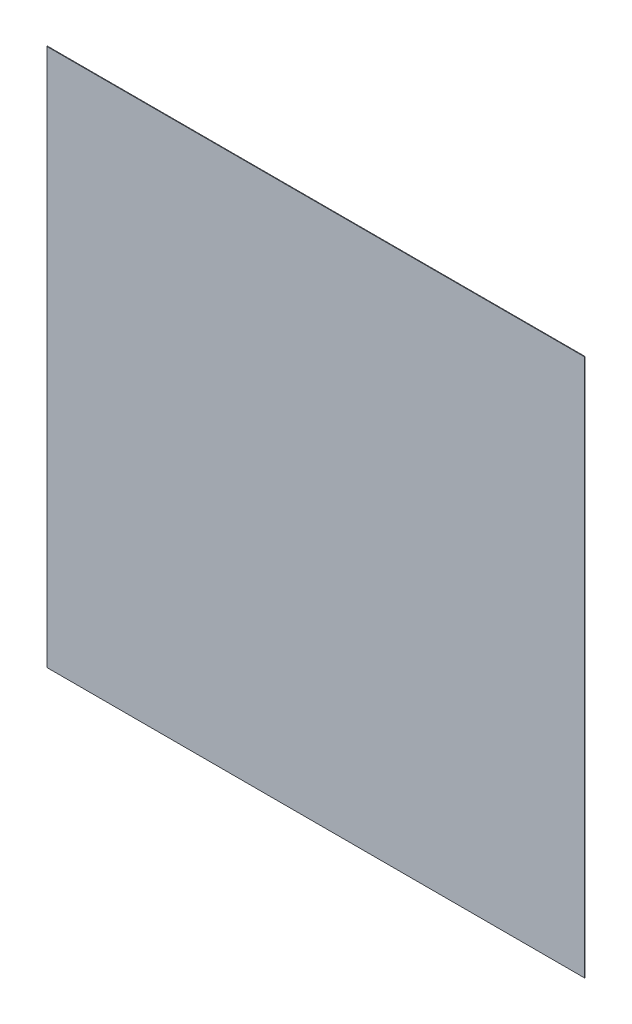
ISO-10303-21;
HEADER;
FILE_DESCRIPTION(('STEP AP214'),'2;1');
FILE_NAME('part.step','',(''),(''),'','','');
FILE_SCHEMA(('AUTOMOTIVE_DESIGN { 1 0 10303 214 1 1 1 1 }'));
ENDSEC;
DATA;
#1=APPLICATION_CONTEXT('core data for automotive mechanical design processes');
#2=APPLICATION_PROTOCOL_DEFINITION('international standard','automotive_design',2000,#1);
#3=PRODUCT_CONTEXT('',#1,'mechanical');
#4=PRODUCT('Part','Part','',(#3));
#5=PRODUCT_RELATED_PRODUCT_CATEGORY('part','',(#4));
#6=PRODUCT_DEFINITION_FORMATION('','',#4);
#7=PRODUCT_DEFINITION_CONTEXT('part definition',#1,'design');
#8=PRODUCT_DEFINITION('design','',#6,#7);
#9=PRODUCT_DEFINITION_SHAPE('','',#8);
#10=(LENGTH_UNIT() NAMED_UNIT(*) SI_UNIT(.MILLI.,.METRE.));
#11=(NAMED_UNIT(*) PLANE_ANGLE_UNIT() SI_UNIT($,.RADIAN.));
#12=(NAMED_UNIT(*) SI_UNIT($,.STERADIAN.) SOLID_ANGLE_UNIT());
#13=UNCERTAINTY_MEASURE_WITH_UNIT(LENGTH_MEASURE(1.E-05),#10,'distance_accuracy_value','');
#14=(GEOMETRIC_REPRESENTATION_CONTEXT(3) GLOBAL_UNCERTAINTY_ASSIGNED_CONTEXT((#13)) GLOBAL_UNIT_ASSIGNED_CONTEXT((#10,
#11,#12)) REPRESENTATION_CONTEXT('',''));
#15=CARTESIAN_POINT('',(0.,0.,0.));
#16=DIRECTION('',(0.,0.,1.));
#17=DIRECTION('',(1.,0.,0.));
#18=AXIS2_PLACEMENT_3D('',#15,#16,#17);
#19=CARTESIAN_POINT('',(0.,0.,0.01));
#20=DIRECTION('',(0.,0.,1.));
#21=DIRECTION('',(1.,0.,0.));
#22=AXIS2_PLACEMENT_3D('',#19,#20,#21);
#23=PLANE('',#22);
#24=DIRECTION('',(1.,0.,0.));
#25=VECTOR('',#24,1.);
#26=CARTESIAN_POINT('',(9.,9.,0.01));
#27=LINE('',#26,#25);
#28=CARTESIAN_POINT('',(0.,9.,0.01));
#29=VERTEX_POINT('',#28);
#30=CARTESIAN_POINT('',(9.,9.,0.01));
#31=VERTEX_POINT('',#30);
#32=EDGE_CURVE('E67',#29,#31,#27,.T.);
#33=ORIENTED_EDGE('',*,*,#32,.F.);
#34=DIRECTION('',(0.,1.,0.));
#35=VECTOR('',#34,1.);
#36=CARTESIAN_POINT('',(0.,9.,0.01));
#37=LINE('',#36,#35);
#38=CARTESIAN_POINT('',(0.,0.,0.01));
#39=VERTEX_POINT('',#38);
#40=EDGE_CURVE('E19',#39,#29,#37,.T.);
#41=ORIENTED_EDGE('',*,*,#40,.F.);
#42=DIRECTION('',(1.,0.,0.));
#43=VECTOR('',#42,1.);
#44=CARTESIAN_POINT('',(0.,0.,0.01));
#45=LINE('',#44,#43);
#46=CARTESIAN_POINT('',(9.,0.,0.01));
#47=VERTEX_POINT('',#46);
#48=EDGE_CURVE('E57',#47,#39,#45,.F.);
#49=ORIENTED_EDGE('',*,*,#48,.F.);
#50=DIRECTION('',(0.,1.,0.));
#51=VECTOR('',#50,1.);
#52=CARTESIAN_POINT('',(9.,0.,0.01));
#53=LINE('',#52,#51);
#54=EDGE_CURVE('E52',#31,#47,#53,.F.);
#55=ORIENTED_EDGE('',*,*,#54,.F.);
#56=EDGE_LOOP('',(#33,#41,#49,#55));
#57=FACE_BOUND('',#56,.T.);
#58=ADVANCED_FACE('F16',(#57),#23,.T.);
#59=CARTESIAN_POINT('',(0.,9.,0.));
#60=DIRECTION('',(-1.,0.,0.));
#61=DIRECTION('',(0.,0.,1.));
#62=AXIS2_PLACEMENT_3D('',#59,#60,#61);
#63=PLANE('',#62);
#64=DIRECTION('',(0.,0.,1.));
#65=VECTOR('',#64,1.);
#66=CARTESIAN_POINT('',(0.,9.,0.));
#67=LINE('',#66,#65);
#68=CARTESIAN_POINT('',(0.,9.,0.));
#69=VERTEX_POINT('',#68);
#70=EDGE_CURVE('E78',#69,#29,#67,.T.);
#71=ORIENTED_EDGE('',*,*,#70,.F.);
#72=DIRECTION('',(0.,1.,0.));
#73=VECTOR('',#72,1.);
#74=CARTESIAN_POINT('',(0.,0.,0.));
#75=LINE('',#74,#73);
#76=CARTESIAN_POINT('',(0.,0.,0.));
#77=VERTEX_POINT('',#76);
#78=EDGE_CURVE('E73',#69,#77,#75,.F.);
#79=ORIENTED_EDGE('',*,*,#78,.T.);
#80=DIRECTION('',(0.,0.,-1.));
#81=VECTOR('',#80,1.);
#82=CARTESIAN_POINT('',(0.,0.,0.));
#83=LINE('',#82,#81);
#84=EDGE_CURVE('E62',#39,#77,#83,.T.);
#85=ORIENTED_EDGE('',*,*,#84,.F.);
#86=ORIENTED_EDGE('',*,*,#40,.T.);
#87=EDGE_LOOP('',(#71,#79,#85,#86));
#88=FACE_BOUND('',#87,.T.);
#89=ADVANCED_FACE('F72',(#88),#63,.T.);
#90=CARTESIAN_POINT('',(0.,0.,0.));
#91=DIRECTION('',(0.,-1.,0.));
#92=DIRECTION('',(0.,0.,-1.));
#93=AXIS2_PLACEMENT_3D('',#90,#91,#92);
#94=PLANE('',#93);
#95=ORIENTED_EDGE('',*,*,#84,.T.);
#96=DIRECTION('',(1.,0.,0.));
#97=VECTOR('',#96,1.);
#98=CARTESIAN_POINT('',(0.,0.,0.));
#99=LINE('',#98,#97);
#100=CARTESIAN_POINT('',(9.,0.,0.));
#101=VERTEX_POINT('',#100);
#102=EDGE_CURVE('E83',#77,#101,#99,.T.);
#103=ORIENTED_EDGE('',*,*,#102,.T.);
#104=DIRECTION('',(0.,0.,-1.));
#105=VECTOR('',#104,1.);
#106=CARTESIAN_POINT('',(9.,0.,0.));
#107=LINE('',#106,#105);
#108=EDGE_CURVE('E64',#47,#101,#107,.T.);
#109=ORIENTED_EDGE('',*,*,#108,.F.);
#110=ORIENTED_EDGE('',*,*,#48,.T.);
#111=EDGE_LOOP('',(#95,#103,#109,#110));
#112=FACE_BOUND('',#111,.T.);
#113=ADVANCED_FACE('F59',(#112),#94,.T.);
#114=CARTESIAN_POINT('',(9.,0.,0.));
#115=DIRECTION('',(1.,0.,0.));
#116=DIRECTION('',(0.,0.,-1.));
#117=AXIS2_PLACEMENT_3D('',#114,#115,#116);
#118=PLANE('',#117);
#119=ORIENTED_EDGE('',*,*,#108,.T.);
#120=DIRECTION('',(0.,1.,0.));
#121=VECTOR('',#120,1.);
#122=CARTESIAN_POINT('',(9.,0.,0.));
#123=LINE('',#122,#121);
#124=CARTESIAN_POINT('',(9.,9.,0.));
#125=VERTEX_POINT('',#124);
#126=EDGE_CURVE('E25',#101,#125,#123,.T.);
#127=ORIENTED_EDGE('',*,*,#126,.T.);
#128=DIRECTION('',(0.,0.,1.));
#129=VECTOR('',#128,1.);
#130=CARTESIAN_POINT('',(9.,9.,0.));
#131=LINE('',#130,#129);
#132=EDGE_CURVE('E33',#31,#125,#131,.F.);
#133=ORIENTED_EDGE('',*,*,#132,.F.);
#134=ORIENTED_EDGE('',*,*,#54,.T.);
#135=EDGE_LOOP('',(#119,#127,#133,#134));
#136=FACE_BOUND('',#135,.T.);
#137=ADVANCED_FACE('F87',(#136),#118,.T.);
#138=CARTESIAN_POINT('',(9.,9.,0.));
#139=DIRECTION('',(0.,1.,0.));
#140=DIRECTION('',(0.,0.,1.));
#141=AXIS2_PLACEMENT_3D('',#138,#139,#140);
#142=PLANE('',#141);
#143=ORIENTED_EDGE('',*,*,#132,.T.);
#144=DIRECTION('',(1.,0.,0.));
#145=VECTOR('',#144,1.);
#146=CARTESIAN_POINT('',(0.,9.,0.));
#147=LINE('',#146,#145);
#148=EDGE_CURVE('E11',#125,#69,#147,.F.);
#149=ORIENTED_EDGE('',*,*,#148,.T.);
#150=ORIENTED_EDGE('',*,*,#70,.T.);
#151=ORIENTED_EDGE('',*,*,#32,.T.);
#152=EDGE_LOOP('',(#143,#149,#150,#151));
#153=FACE_BOUND('',#152,.T.);
#154=ADVANCED_FACE('F90',(#153),#142,.T.);
#155=CARTESIAN_POINT('',(0.,0.,0.));
#156=DIRECTION('',(0.,0.,1.));
#157=DIRECTION('',(1.,0.,0.));
#158=AXIS2_PLACEMENT_3D('',#155,#156,#157);
#159=PLANE('',#158);
#160=ORIENTED_EDGE('',*,*,#126,.F.);
#161=ORIENTED_EDGE('',*,*,#102,.F.);
#162=ORIENTED_EDGE('',*,*,#78,.F.);
#163=ORIENTED_EDGE('',*,*,#148,.F.);
#164=EDGE_LOOP('',(#160,#161,#162,#163));
#165=FACE_BOUND('',#164,.T.);
#166=ADVANCED_FACE('F89',(#165),#159,.F.);
#167=CLOSED_SHELL('',(#58,#89,#113,#137,#154,#166));
#168=MANIFOLD_SOLID_BREP('B1',#167);
#169=ADVANCED_BREP_SHAPE_REPRESENTATION('',(#18,#168),#14);
#170=SHAPE_DEFINITION_REPRESENTATION(#9,#169);
ENDSEC;
END-ISO-10303-21;
